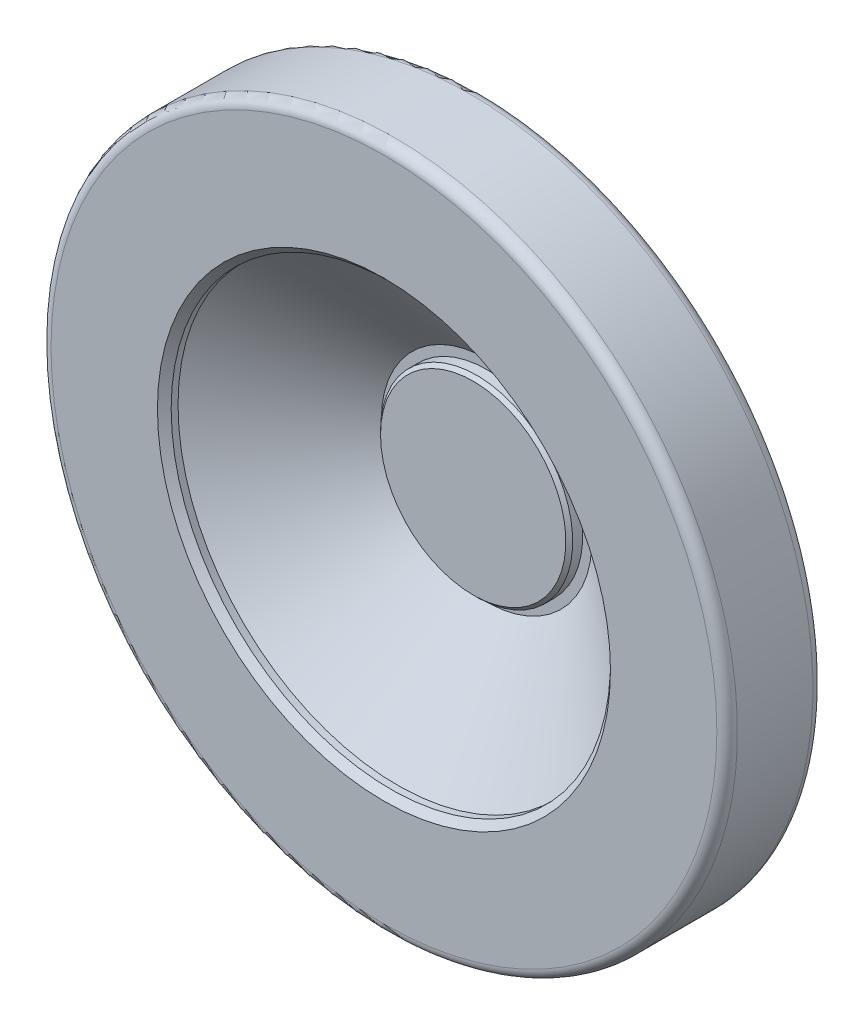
ISO-10303-21;
HEADER;
FILE_DESCRIPTION(('STEP AP214'),'2;1');
FILE_NAME('part.step','',(''),(''),'','','');
FILE_SCHEMA(('AUTOMOTIVE_DESIGN { 1 0 10303 214 1 1 1 1 }'));
ENDSEC;
DATA;
#1=APPLICATION_CONTEXT('core data for automotive mechanical design processes');
#2=APPLICATION_PROTOCOL_DEFINITION('international standard','automotive_design',2000,#1);
#3=PRODUCT_CONTEXT('',#1,'mechanical');
#4=PRODUCT('Part','Part','',(#3));
#5=PRODUCT_RELATED_PRODUCT_CATEGORY('part','',(#4));
#6=PRODUCT_DEFINITION_FORMATION('','',#4);
#7=PRODUCT_DEFINITION_CONTEXT('part definition',#1,'design');
#8=PRODUCT_DEFINITION('design','',#6,#7);
#9=PRODUCT_DEFINITION_SHAPE('','',#8);
#10=(LENGTH_UNIT() NAMED_UNIT(*) SI_UNIT(.MILLI.,.METRE.));
#11=(NAMED_UNIT(*) PLANE_ANGLE_UNIT() SI_UNIT($,.RADIAN.));
#12=(NAMED_UNIT(*) SI_UNIT($,.STERADIAN.) SOLID_ANGLE_UNIT());
#13=UNCERTAINTY_MEASURE_WITH_UNIT(LENGTH_MEASURE(1.E-05),#10,'distance_accuracy_value','');
#14=(GEOMETRIC_REPRESENTATION_CONTEXT(3) GLOBAL_UNCERTAINTY_ASSIGNED_CONTEXT((#13)) GLOBAL_UNIT_ASSIGNED_CONTEXT((#10,
#11,#12)) REPRESENTATION_CONTEXT('',''));
#15=CARTESIAN_POINT('',(0.,0.,0.));
#16=DIRECTION('',(0.,0.,1.));
#17=DIRECTION('',(1.,0.,0.));
#18=AXIS2_PLACEMENT_3D('',#15,#16,#17);
#19=CARTESIAN_POINT('',(0.,0.,48.));
#20=DIRECTION('',(0.,0.,1.));
#21=DIRECTION('',(-1.,0.,0.));
#22=AXIS2_PLACEMENT_3D('',#19,#20,#21);
#23=CYLINDRICAL_SURFACE('',#22,13.9999999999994);
#24=CARTESIAN_POINT('',(0.,0.,24.5));
#25=DIRECTION('',(0.,0.,1.));
#26=DIRECTION('',(-1.,0.,0.));
#27=AXIS2_PLACEMENT_3D('',#24,#25,#26);
#28=CIRCLE('',#27,13.9999999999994);
#29=CARTESIAN_POINT('',(-13.9999999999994,0.,24.5));
#30=VERTEX_POINT('',#29);
#31=EDGE_CURVE('E9',#30,#30,#28,.T.);
#32=ORIENTED_EDGE('',*,*,#31,.F.);
#33=EDGE_LOOP('',(#32));
#34=FACE_BOUND('',#33,.T.);
#35=CARTESIAN_POINT('',(0.,0.,23.0446393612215));
#36=DIRECTION('',(0.,0.,1.));
#37=DIRECTION('',(-1.,0.,0.));
#38=AXIS2_PLACEMENT_3D('',#35,#36,#37);
#39=CIRCLE('',#38,13.9999999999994);
#40=CARTESIAN_POINT('',(-13.9999999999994,0.,23.0446393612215));
#41=VERTEX_POINT('',#40);
#42=EDGE_CURVE('E87',#41,#41,#39,.T.);
#43=ORIENTED_EDGE('',*,*,#42,.T.);
#44=EDGE_LOOP('',(#43));
#45=FACE_BOUND('',#44,.T.);
#46=ADVANCED_FACE('F14',(#34,#45),#23,.T.);
#47=CARTESIAN_POINT('',(0.,0.,25.));
#48=DIRECTION('',(0.,0.,-1.));
#49=DIRECTION('',(1.,0.,0.));
#50=AXIS2_PLACEMENT_3D('',#47,#48,#49);
#51=CONICAL_SURFACE('',#50,13.4999999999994,0.785398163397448);
#52=ORIENTED_EDGE('',*,*,#31,.T.);
#53=EDGE_LOOP('',(#52));
#54=FACE_BOUND('',#53,.T.);
#55=CARTESIAN_POINT('',(0.,0.,25.));
#56=DIRECTION('',(0.,0.,1.));
#57=DIRECTION('',(-1.,0.,0.));
#58=AXIS2_PLACEMENT_3D('',#55,#56,#57);
#59=CIRCLE('',#58,13.4999999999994);
#60=CARTESIAN_POINT('',(-13.4999999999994,0.,25.));
#61=VERTEX_POINT('',#60);
#62=EDGE_CURVE('E20',#61,#61,#59,.T.);
#63=ORIENTED_EDGE('',*,*,#62,.F.);
#64=EDGE_LOOP('',(#63));
#65=FACE_BOUND('',#64,.T.);
#66=ADVANCED_FACE('F142',(#54,#65),#51,.T.);
#67=CARTESIAN_POINT('',(0.,-13.5,25.));
#68=DIRECTION('',(0.,0.,-1.));
#69=DIRECTION('',(1.,0.,0.));
#70=AXIS2_PLACEMENT_3D('',#67,#68,#69);
#71=PLANE('',#70);
#72=ORIENTED_EDGE('',*,*,#62,.T.);
#73=EDGE_LOOP('',(#72));
#74=FACE_BOUND('',#73,.T.);
#75=ADVANCED_FACE('F27',(#74),#71,.F.);
#76=CARTESIAN_POINT('',(0.,0.,10.));
#77=DIRECTION('',(0.,0.,-1.));
#78=DIRECTION('',(1.,0.,0.));
#79=AXIS2_PLACEMENT_3D('',#76,#77,#78);
#80=CONICAL_SURFACE('',#79,3.00000000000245,1.04719755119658);
#81=CARTESIAN_POINT('',(0.,3.81469740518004E-06,11.732048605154));
#82=VERTEX_POINT('',#81);
#83=VERTEX_LOOP('',#82);
#84=FACE_BOUND('',#83,.T.);
#85=CARTESIAN_POINT('',(0.,0.,10.));
#86=DIRECTION('',(0.,0.,1.));
#87=DIRECTION('',(-1.,0.,0.));
#88=AXIS2_PLACEMENT_3D('',#85,#86,#87);
#89=CIRCLE('',#88,3.00000000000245);
#90=CARTESIAN_POINT('',(-3.00000000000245,0.,10.));
#91=VERTEX_POINT('',#90);
#92=EDGE_CURVE('E31',#91,#91,#89,.T.);
#93=ORIENTED_EDGE('',*,*,#92,.F.);
#94=EDGE_LOOP('',(#93));
#95=FACE_BOUND('',#94,.T.);
#96=ADVANCED_FACE('F23',(#84,#95),#80,.F.);
#97=CARTESIAN_POINT('',(0.,0.,48.));
#98=DIRECTION('',(0.,0.,1.));
#99=DIRECTION('',(-1.,0.,0.));
#100=AXIS2_PLACEMENT_3D('',#97,#98,#99);
#101=CYLINDRICAL_SURFACE('',#100,3.00000000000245);
#102=ORIENTED_EDGE('',*,*,#92,.T.);
#103=EDGE_LOOP('',(#102));
#104=FACE_BOUND('',#103,.T.);
#105=CARTESIAN_POINT('',(0.,0.,0.));
#106=DIRECTION('',(0.,0.,1.));
#107=DIRECTION('',(-1.,0.,0.));
#108=AXIS2_PLACEMENT_3D('',#105,#106,#107);
#109=CIRCLE('',#108,3.00000000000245);
#110=CARTESIAN_POINT('',(-3.00000000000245,0.,0.));
#111=VERTEX_POINT('',#110);
#112=EDGE_CURVE('E33',#111,#111,#109,.T.);
#113=ORIENTED_EDGE('',*,*,#112,.F.);
#114=EDGE_LOOP('',(#113));
#115=FACE_BOUND('',#114,.T.);
#116=ADVANCED_FACE('F26',(#104,#115),#101,.F.);
#117=CARTESIAN_POINT('',(0.,-13.,0.));
#118=DIRECTION('',(0.,0.,-1.));
#119=DIRECTION('',(1.,0.,0.));
#120=AXIS2_PLACEMENT_3D('',#117,#118,#119);
#121=PLANE('',#120);
#122=ORIENTED_EDGE('',*,*,#112,.T.);
#123=EDGE_LOOP('',(#122));
#124=FACE_BOUND('',#123,.T.);
#125=CARTESIAN_POINT('',(0.,0.,0.));
#126=DIRECTION('',(0.,0.,1.));
#127=DIRECTION('',(-1.,0.,0.));
#128=AXIS2_PLACEMENT_3D('',#125,#126,#127);
#129=CIRCLE('',#128,12.9999999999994);
#130=CARTESIAN_POINT('',(-12.9999999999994,0.,0.));
#131=VERTEX_POINT('',#130);
#132=EDGE_CURVE('E37',#131,#131,#129,.T.);
#133=ORIENTED_EDGE('',*,*,#132,.F.);
#134=EDGE_LOOP('',(#133));
#135=FACE_BOUND('',#134,.T.);
#136=ADVANCED_FACE('F161',(#124,#135),#121,.T.);
#137=CARTESIAN_POINT('',(0.,0.,1.));
#138=DIRECTION('',(0.,0.,1.));
#139=DIRECTION('',(-1.,0.,0.));
#140=AXIS2_PLACEMENT_3D('',#137,#138,#139);
#141=CONICAL_SURFACE('',#140,13.9999999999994,0.785398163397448);
#142=ORIENTED_EDGE('',*,*,#132,.T.);
#143=EDGE_LOOP('',(#142));
#144=FACE_BOUND('',#143,.T.);
#145=CARTESIAN_POINT('',(0.,0.,1.));
#146=DIRECTION('',(0.,0.,1.));
#147=DIRECTION('',(-1.,0.,0.));
#148=AXIS2_PLACEMENT_3D('',#145,#146,#147);
#149=CIRCLE('',#148,13.9999999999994);
#150=CARTESIAN_POINT('',(-13.9999999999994,0.,1.));
#151=VERTEX_POINT('',#150);
#152=EDGE_CURVE('E42',#151,#151,#149,.T.);
#153=ORIENTED_EDGE('',*,*,#152,.F.);
#154=EDGE_LOOP('',(#153));
#155=FACE_BOUND('',#154,.T.);
#156=ADVANCED_FACE('F164',(#144,#155),#141,.T.);
#157=CARTESIAN_POINT('',(0.,0.,48.));
#158=DIRECTION('',(0.,0.,1.));
#159=DIRECTION('',(-1.,0.,0.));
#160=AXIS2_PLACEMENT_3D('',#157,#158,#159);
#161=CYLINDRICAL_SURFACE('',#160,13.9999999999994);
#162=CARTESIAN_POINT('',(0.,0.,13.6));
#163=DIRECTION('',(0.,0.,1.));
#164=DIRECTION('',(-1.,0.,0.));
#165=AXIS2_PLACEMENT_3D('',#162,#163,#164);
#166=CIRCLE('',#165,13.9999999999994);
#167=CARTESIAN_POINT('',(-13.9999999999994,0.,13.6));
#168=VERTEX_POINT('',#167);
#169=EDGE_CURVE('E45',#168,#168,#166,.T.);
#170=ORIENTED_EDGE('',*,*,#169,.F.);
#171=EDGE_LOOP('',(#170));
#172=FACE_BOUND('',#171,.T.);
#173=ORIENTED_EDGE('',*,*,#152,.T.);
#174=EDGE_LOOP('',(#173));
#175=FACE_BOUND('',#174,.T.);
#176=ADVANCED_FACE('F168',(#172,#175),#161,.T.);
#177=CARTESIAN_POINT('',(0.,0.,13.6));
#178=DIRECTION('',(0.,0.,1.));
#179=DIRECTION('',(-1.,0.,0.));
#180=AXIS2_PLACEMENT_3D('',#177,#178,#179);
#181=TOROIDAL_SURFACE('',#180,14.3999999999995,0.400000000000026);
#182=ORIENTED_EDGE('',*,*,#169,.T.);
#183=EDGE_LOOP('',(#182));
#184=FACE_BOUND('',#183,.T.);
#185=CARTESIAN_POINT('',(0.,0.,14.));
#186=DIRECTION('',(0.,0.,1.));
#187=DIRECTION('',(-1.,0.,0.));
#188=AXIS2_PLACEMENT_3D('',#185,#186,#187);
#189=CIRCLE('',#188,14.3999999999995);
#190=CARTESIAN_POINT('',(-14.3999999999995,0.,14.));
#191=VERTEX_POINT('',#190);
#192=EDGE_CURVE('E48',#191,#191,#189,.T.);
#193=ORIENTED_EDGE('',*,*,#192,.F.);
#194=EDGE_LOOP('',(#193));
#195=FACE_BOUND('',#194,.T.);
#196=ADVANCED_FACE('F172',(#184,#195),#181,.F.);
#197=CARTESIAN_POINT('',(0.,-14.4,14.));
#198=DIRECTION('',(0.,0.,1.));
#199=DIRECTION('',(-1.,0.,0.));
#200=AXIS2_PLACEMENT_3D('',#197,#198,#199);
#201=PLANE('',#200);
#202=CARTESIAN_POINT('',(0.,0.,14.));
#203=DIRECTION('',(0.,0.,1.));
#204=DIRECTION('',(-1.,0.,0.));
#205=AXIS2_PLACEMENT_3D('',#202,#203,#204);
#206=CIRCLE('',#205,15.9999999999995);
#207=CARTESIAN_POINT('',(-15.9999999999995,0.,14.));
#208=VERTEX_POINT('',#207);
#209=EDGE_CURVE('E51',#208,#208,#206,.T.);
#210=ORIENTED_EDGE('',*,*,#209,.F.);
#211=EDGE_LOOP('',(#210));
#212=FACE_BOUND('',#211,.T.);
#213=ORIENTED_EDGE('',*,*,#192,.T.);
#214=EDGE_LOOP('',(#213));
#215=FACE_BOUND('',#214,.T.);
#216=ADVANCED_FACE('F176',(#212,#215),#201,.F.);
#217=CARTESIAN_POINT('',(0.,0.,48.));
#218=DIRECTION('',(0.,0.,1.));
#219=DIRECTION('',(-1.,0.,0.));
#220=AXIS2_PLACEMENT_3D('',#217,#218,#219);
#221=CYLINDRICAL_SURFACE('',#220,15.9999999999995);
#222=CARTESIAN_POINT('',(0.,0.,15.610136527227));
#223=DIRECTION('',(0.,0.,1.));
#224=DIRECTION('',(-1.,0.,0.));
#225=AXIS2_PLACEMENT_3D('',#222,#223,#224);
#226=CIRCLE('',#225,15.9999999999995);
#227=CARTESIAN_POINT('',(-15.9999999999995,0.,15.610136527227));
#228=VERTEX_POINT('',#227);
#229=EDGE_CURVE('E54',#228,#228,#226,.T.);
#230=ORIENTED_EDGE('',*,*,#229,.F.);
#231=EDGE_LOOP('',(#230));
#232=FACE_BOUND('',#231,.T.);
#233=ORIENTED_EDGE('',*,*,#209,.T.);
#234=EDGE_LOOP('',(#233));
#235=FACE_BOUND('',#234,.T.);
#236=ADVANCED_FACE('F180',(#232,#235),#221,.T.);
#237=CARTESIAN_POINT('',(0.,0.,15.610136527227));
#238=DIRECTION('',(0.,0.,1.));
#239=DIRECTION('',(-1.,0.,0.));
#240=AXIS2_PLACEMENT_3D('',#237,#238,#239);
#241=TOROIDAL_SURFACE('',#240,20.9999999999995,5.);
#242=ORIENTED_EDGE('',*,*,#229,.T.);
#243=EDGE_LOOP('',(#242));
#244=FACE_BOUND('',#243,.T.);
#245=CARTESIAN_POINT('',(0.,0.,19.556897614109));
#246=DIRECTION('',(0.,0.,1.));
#247=DIRECTION('',(-1.,0.,0.));
#248=AXIS2_PLACEMENT_3D('',#245,#246,#247);
#249=CIRCLE('',#248,17.930296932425);
#250=CARTESIAN_POINT('',(-17.930296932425,0.,19.556897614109));
#251=VERTEX_POINT('',#250);
#252=EDGE_CURVE('E57',#251,#251,#249,.T.);
#253=ORIENTED_EDGE('',*,*,#252,.F.);
#254=EDGE_LOOP('',(#253));
#255=FACE_BOUND('',#254,.T.);
#256=ADVANCED_FACE('F184',(#244,#255),#241,.F.);
#257=CARTESIAN_POINT('',(0.,0.,19.556897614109));
#258=DIRECTION('',(0.,0.,1.));
#259=DIRECTION('',(-1.,0.,0.));
#260=AXIS2_PLACEMENT_3D('',#257,#258,#259);
#261=CONICAL_SURFACE('',#260,17.930296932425,0.909753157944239);
#262=CARTESIAN_POINT('',(0.,0.,24.));
#263=DIRECTION('',(0.,0.,1.));
#264=DIRECTION('',(-1.,0.,0.));
#265=AXIS2_PLACEMENT_3D('',#262,#263,#264);
#266=CIRCLE('',#265,23.642857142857);
#267=CARTESIAN_POINT('',(-23.642857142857,0.,24.));
#268=VERTEX_POINT('',#267);
#269=EDGE_CURVE('E60',#268,#268,#266,.T.);
#270=ORIENTED_EDGE('',*,*,#269,.F.);
#271=EDGE_LOOP('',(#270));
#272=FACE_BOUND('',#271,.T.);
#273=ORIENTED_EDGE('',*,*,#252,.T.);
#274=EDGE_LOOP('',(#273));
#275=FACE_BOUND('',#274,.T.);
#276=ADVANCED_FACE('F188',(#272,#275),#261,.T.);
#277=CARTESIAN_POINT('',(0.,-48.5,24.));
#278=DIRECTION('',(0.,0.,-1.));
#279=DIRECTION('',(1.,0.,0.));
#280=AXIS2_PLACEMENT_3D('',#277,#278,#279);
#281=PLANE('',#280);
#282=ORIENTED_EDGE('',*,*,#269,.T.);
#283=EDGE_LOOP('',(#282));
#284=FACE_BOUND('',#283,.T.);
#285=CARTESIAN_POINT('',(0.,0.,24.));
#286=DIRECTION('',(0.,0.,1.));
#287=DIRECTION('',(-1.,0.,0.));
#288=AXIS2_PLACEMENT_3D('',#285,#286,#287);
#289=CIRCLE('',#288,48.5);
#290=CARTESIAN_POINT('',(-48.5,0.,24.));
#291=VERTEX_POINT('',#290);
#292=EDGE_CURVE('E63',#291,#291,#289,.T.);
#293=ORIENTED_EDGE('',*,*,#292,.F.);
#294=EDGE_LOOP('',(#293));
#295=FACE_BOUND('',#294,.T.);
#296=ADVANCED_FACE('F138',(#284,#295),#281,.T.);
#297=CARTESIAN_POINT('',(0.,0.,25.5));
#298=DIRECTION('',(0.,0.,1.));
#299=DIRECTION('',(-1.,0.,0.));
#300=AXIS2_PLACEMENT_3D('',#297,#298,#299);
#301=TOROIDAL_SURFACE('',#300,48.5,1.5);
#302=CARTESIAN_POINT('',(0.,0.,25.5));
#303=DIRECTION('',(0.,0.,1.));
#304=DIRECTION('',(-1.,0.,0.));
#305=AXIS2_PLACEMENT_3D('',#302,#303,#304);
#306=CIRCLE('',#305,50.);
#307=CARTESIAN_POINT('',(-50.,0.,25.5));
#308=VERTEX_POINT('',#307);
#309=EDGE_CURVE('E66',#308,#308,#306,.T.);
#310=ORIENTED_EDGE('',*,*,#309,.F.);
#311=EDGE_LOOP('',(#310));
#312=FACE_BOUND('',#311,.T.);
#313=ORIENTED_EDGE('',*,*,#292,.T.);
#314=EDGE_LOOP('',(#313));
#315=FACE_BOUND('',#314,.T.);
#316=ADVANCED_FACE('F130',(#312,#315),#301,.T.);
#317=CARTESIAN_POINT('',(0.,0.,48.));
#318=DIRECTION('',(0.,0.,1.));
#319=DIRECTION('',(-1.,0.,0.));
#320=AXIS2_PLACEMENT_3D('',#317,#318,#319);
#321=CYLINDRICAL_SURFACE('',#320,50.);
#322=ORIENTED_EDGE('',*,*,#309,.T.);
#323=EDGE_LOOP('',(#322));
#324=FACE_BOUND('',#323,.T.);
#325=CARTESIAN_POINT('',(0.,0.,36.5));
#326=DIRECTION('',(0.,0.,1.));
#327=DIRECTION('',(-1.,0.,0.));
#328=AXIS2_PLACEMENT_3D('',#325,#326,#327);
#329=CIRCLE('',#328,50.);
#330=CARTESIAN_POINT('',(-50.,0.,36.5));
#331=VERTEX_POINT('',#330);
#332=EDGE_CURVE('E69',#331,#331,#329,.T.);
#333=ORIENTED_EDGE('',*,*,#332,.F.);
#334=EDGE_LOOP('',(#333));
#335=FACE_BOUND('',#334,.T.);
#336=ADVANCED_FACE('F125',(#324,#335),#321,.T.);
#337=CARTESIAN_POINT('',(0.,0.,36.5));
#338=DIRECTION('',(0.,0.,1.));
#339=DIRECTION('',(-1.,0.,0.));
#340=AXIS2_PLACEMENT_3D('',#337,#338,#339);
#341=TOROIDAL_SURFACE('',#340,48.5,1.5);
#342=CARTESIAN_POINT('',(0.,0.,38.));
#343=DIRECTION('',(0.,0.,1.));
#344=DIRECTION('',(-1.,0.,0.));
#345=AXIS2_PLACEMENT_3D('',#342,#343,#344);
#346=CIRCLE('',#345,48.5);
#347=CARTESIAN_POINT('',(-48.5,0.,38.));
#348=VERTEX_POINT('',#347);
#349=EDGE_CURVE('E72',#348,#348,#346,.T.);
#350=ORIENTED_EDGE('',*,*,#349,.F.);
#351=EDGE_LOOP('',(#350));
#352=FACE_BOUND('',#351,.T.);
#353=ORIENTED_EDGE('',*,*,#332,.T.);
#354=EDGE_LOOP('',(#353));
#355=FACE_BOUND('',#354,.T.);
#356=ADVANCED_FACE('F119',(#352,#355),#341,.T.);
#357=CARTESIAN_POINT('',(0.,-48.5,38.));
#358=DIRECTION('',(0.,0.,-1.));
#359=DIRECTION('',(1.,0.,0.));
#360=AXIS2_PLACEMENT_3D('',#357,#358,#359);
#361=PLANE('',#360);
#362=CARTESIAN_POINT('',(0.,0.,38.));
#363=DIRECTION('',(0.,0.,1.));
#364=DIRECTION('',(-1.,0.,0.));
#365=AXIS2_PLACEMENT_3D('',#362,#363,#364);
#366=CIRCLE('',#365,33.);
#367=CARTESIAN_POINT('',(-33.,0.,38.));
#368=VERTEX_POINT('',#367);
#369=EDGE_CURVE('E75',#368,#368,#366,.T.);
#370=ORIENTED_EDGE('',*,*,#369,.F.);
#371=EDGE_LOOP('',(#370));
#372=FACE_BOUND('',#371,.T.);
#373=ORIENTED_EDGE('',*,*,#349,.T.);
#374=EDGE_LOOP('',(#373));
#375=FACE_BOUND('',#374,.T.);
#376=ADVANCED_FACE('F113',(#372,#375),#361,.F.);
#377=CARTESIAN_POINT('',(0.,0.,38.));
#378=DIRECTION('',(0.,0.,1.));
#379=DIRECTION('',(-1.,0.,0.));
#380=AXIS2_PLACEMENT_3D('',#377,#378,#379);
#381=CONICAL_SURFACE('',#380,33.,0.785398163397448);
#382=CARTESIAN_POINT('',(0.,0.,37.));
#383=DIRECTION('',(0.,0.,1.));
#384=DIRECTION('',(-1.,0.,0.));
#385=AXIS2_PLACEMENT_3D('',#382,#383,#384);
#386=CIRCLE('',#385,32.);
#387=CARTESIAN_POINT('',(-32.,0.,37.));
#388=VERTEX_POINT('',#387);
#389=EDGE_CURVE('E78',#388,#388,#386,.T.);
#390=ORIENTED_EDGE('',*,*,#389,.F.);
#391=EDGE_LOOP('',(#390));
#392=FACE_BOUND('',#391,.T.);
#393=ORIENTED_EDGE('',*,*,#369,.T.);
#394=EDGE_LOOP('',(#393));
#395=FACE_BOUND('',#394,.T.);
#396=ADVANCED_FACE('F107',(#392,#395),#381,.F.);
#397=CARTESIAN_POINT('',(0.,0.,48.));
#398=DIRECTION('',(0.,0.,1.));
#399=DIRECTION('',(-1.,0.,0.));
#400=AXIS2_PLACEMENT_3D('',#397,#398,#399);
#401=CYLINDRICAL_SURFACE('',#400,32.);
#402=CARTESIAN_POINT('',(0.,0.,36.));
#403=DIRECTION('',(0.,0.,1.));
#404=DIRECTION('',(-1.,0.,0.));
#405=AXIS2_PLACEMENT_3D('',#402,#403,#404);
#406=CIRCLE('',#405,32.);
#407=CARTESIAN_POINT('',(-32.,0.,36.));
#408=VERTEX_POINT('',#407);
#409=EDGE_CURVE('E81',#408,#408,#406,.T.);
#410=ORIENTED_EDGE('',*,*,#409,.F.);
#411=EDGE_LOOP('',(#410));
#412=FACE_BOUND('',#411,.T.);
#413=ORIENTED_EDGE('',*,*,#389,.T.);
#414=EDGE_LOOP('',(#413));
#415=FACE_BOUND('',#414,.T.);
#416=ADVANCED_FACE('F101',(#412,#415),#401,.F.);
#417=CARTESIAN_POINT('',(0.,0.,36.));
#418=DIRECTION('',(0.,0.,1.));
#419=DIRECTION('',(-1.,0.,0.));
#420=AXIS2_PLACEMENT_3D('',#417,#418,#419);
#421=CONICAL_SURFACE('',#420,32.,0.909753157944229);
#422=CARTESIAN_POINT('',(0.,0.,23.0446393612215));
#423=DIRECTION('',(0.,0.,1.));
#424=DIRECTION('',(-1.,0.,0.));
#425=AXIS2_PLACEMENT_3D('',#422,#423,#424);
#426=CIRCLE('',#425,15.343107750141);
#427=CARTESIAN_POINT('',(-15.343107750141,0.,23.0446393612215));
#428=VERTEX_POINT('',#427);
#429=EDGE_CURVE('E84',#428,#428,#426,.T.);
#430=ORIENTED_EDGE('',*,*,#429,.F.);
#431=EDGE_LOOP('',(#430));
#432=FACE_BOUND('',#431,.T.);
#433=ORIENTED_EDGE('',*,*,#409,.T.);
#434=EDGE_LOOP('',(#433));
#435=FACE_BOUND('',#434,.T.);
#436=ADVANCED_FACE('F95',(#432,#435),#421,.F.);
#437=CARTESIAN_POINT('',(0.,-15.343107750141,23.0446393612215));
#438=DIRECTION('',(0.,0.,-1.));
#439=DIRECTION('',(1.,0.,0.));
#440=AXIS2_PLACEMENT_3D('',#437,#438,#439);
#441=PLANE('',#440);
#442=ORIENTED_EDGE('',*,*,#42,.F.);
#443=EDGE_LOOP('',(#442));
#444=FACE_BOUND('',#443,.T.);
#445=ORIENTED_EDGE('',*,*,#429,.T.);
#446=EDGE_LOOP('',(#445));
#447=FACE_BOUND('',#446,.T.);
#448=ADVANCED_FACE('F92',(#444,#447),#441,.F.);
#449=CLOSED_SHELL('',(#46,#66,#75,#96,#116,#136,#156,#176,#196,#216,#236,#256,#276,#296,#316,
#336,#356,#376,#396,#416,#436,#448));
#450=MANIFOLD_SOLID_BREP('B1',#449);
#451=ADVANCED_BREP_SHAPE_REPRESENTATION('',(#18,#450),#14);
#452=SHAPE_DEFINITION_REPRESENTATION(#9,#451);
ENDSEC;
END-ISO-10303-21;
